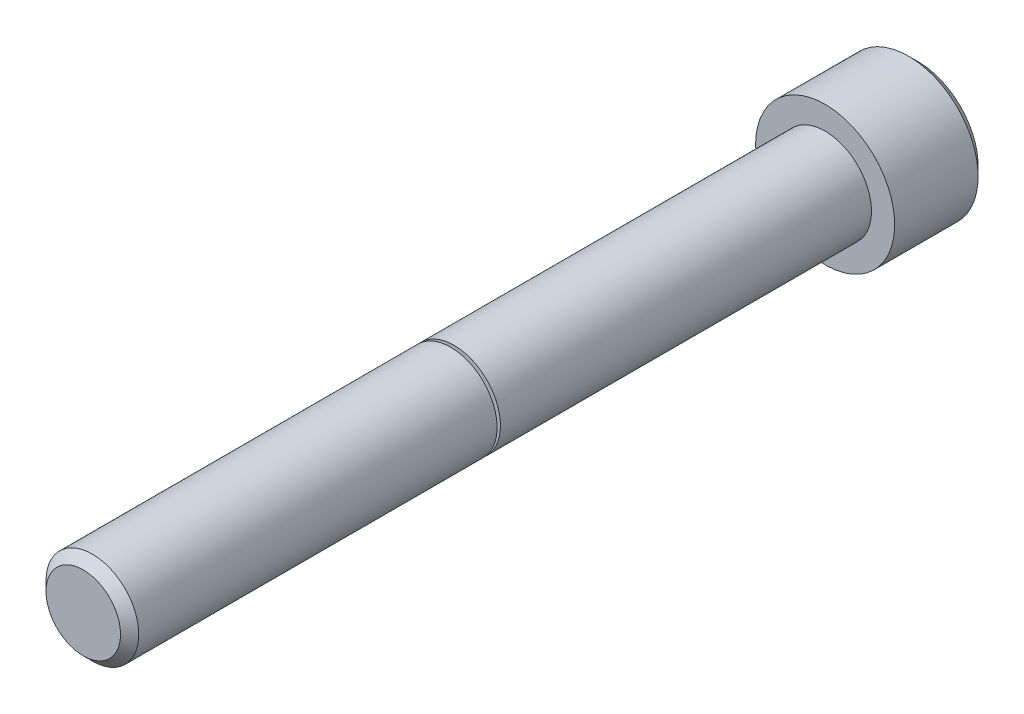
from build123d import *

# Parameters (mm, degrees)
CUT_EXTRUDE1_DEPTH = 3.175


with BuildPart() as part:
    # Logo3_bib1 → Revolve1 (revolve)
    with BuildSketch(Plane(origin=(0, 0, 0), x_dir=(-1, 0, 0), z_dir=(0, -1, 0))):
        with BuildLine():
            Line((0, -50.8), (0, 6.35))
            Line((0, 6.35), (4.1275, 6.35))
            Line((4.1275, 6.35), (4.7625, 5.715))
            Line((4.7625, 5.715), (4.7625, 0))
            Line((4.7625, 0), (3.175, 0))
            Line((3.175, 0), (3.175, -25.41))
            Line((3.175, -25.41), (2.666125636, -25.41))
            ThreePointArc((2.666125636, -25.41), (2.646429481, -25.426527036), (2.659285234, -25.448793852))
            Line((2.659285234, -25.448793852), (3.175, -25.636498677))
            Line((3.175, -25.636498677), (3.175, -50.1777))
            Line((3.175, -50.1777), (2.5527, -50.8))
            Line((2.5527, -50.8), (0, -50.8))
        make_face()
    revolve(axis=Axis((0, 0, -10.585154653), (0, 0, 1)))

    # Logo3_bib2 → Cut-Extrude1 (cut)
    with BuildSketch(Plane(origin=(0, 0, -6.35), x_dir=(1, 0, 0), z_dir=(0, 0, -1))):
        Polygon((2.749630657, 0), (1.374815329, 2.38125), (-1.374815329, 2.38125), (-2.749630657, 0), (-1.374815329, -2.38125), (1.374815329, -2.38125), align=None)
    extrude(amount=-CUT_EXTRUDE1_DEPTH, mode=Mode.SUBTRACT)


solid = part.part
